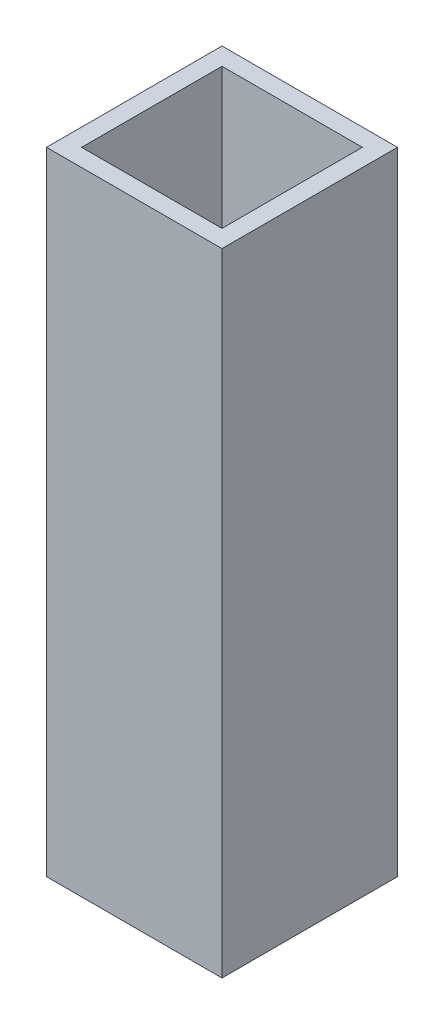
ISO-10303-21;
HEADER;
FILE_DESCRIPTION(('STEP AP214'),'2;1');
FILE_NAME('part.step','',(''),(''),'','','');
FILE_SCHEMA(('AUTOMOTIVE_DESIGN { 1 0 10303 214 1 1 1 1 }'));
ENDSEC;
DATA;
#1=APPLICATION_CONTEXT('core data for automotive mechanical design processes');
#2=APPLICATION_PROTOCOL_DEFINITION('international standard','automotive_design',2000,#1);
#3=PRODUCT_CONTEXT('',#1,'mechanical');
#4=PRODUCT('Part','Part','',(#3));
#5=PRODUCT_RELATED_PRODUCT_CATEGORY('part','',(#4));
#6=PRODUCT_DEFINITION_FORMATION('','',#4);
#7=PRODUCT_DEFINITION_CONTEXT('part definition',#1,'design');
#8=PRODUCT_DEFINITION('design','',#6,#7);
#9=PRODUCT_DEFINITION_SHAPE('','',#8);
#10=(LENGTH_UNIT() NAMED_UNIT(*) SI_UNIT(.MILLI.,.METRE.));
#11=(NAMED_UNIT(*) PLANE_ANGLE_UNIT() SI_UNIT($,.RADIAN.));
#12=(NAMED_UNIT(*) SI_UNIT($,.STERADIAN.) SOLID_ANGLE_UNIT());
#13=UNCERTAINTY_MEASURE_WITH_UNIT(LENGTH_MEASURE(1.E-05),#10,'distance_accuracy_value','');
#14=(GEOMETRIC_REPRESENTATION_CONTEXT(3) GLOBAL_UNCERTAINTY_ASSIGNED_CONTEXT((#13)) GLOBAL_UNIT_ASSIGNED_CONTEXT((#10,
#11,#12)) REPRESENTATION_CONTEXT('',''));
#15=CARTESIAN_POINT('',(0.,0.,0.));
#16=DIRECTION('',(0.,0.,1.));
#17=DIRECTION('',(1.,0.,0.));
#18=AXIS2_PLACEMENT_3D('',#15,#16,#17);
#19=CARTESIAN_POINT('',(6.25,45.,-6.25));
#20=DIRECTION('',(-1.,0.,0.));
#21=DIRECTION('',(0.,0.,1.));
#22=AXIS2_PLACEMENT_3D('',#19,#20,#21);
#23=PLANE('',#22);
#24=DIRECTION('',(0.,0.,-1.));
#25=VECTOR('',#24,1.);
#26=CARTESIAN_POINT('',(6.25,0.,-6.25));
#27=LINE('',#26,#25);
#28=CARTESIAN_POINT('',(6.25,0.,6.25));
#29=VERTEX_POINT('',#28);
#30=CARTESIAN_POINT('',(6.25,0.,-6.25));
#31=VERTEX_POINT('',#30);
#32=EDGE_CURVE('E155',#29,#31,#27,.T.);
#33=ORIENTED_EDGE('',*,*,#32,.T.);
#34=DIRECTION('',(0.,-1.,0.));
#35=VECTOR('',#34,1.);
#36=CARTESIAN_POINT('',(6.25,45.,-6.25));
#37=LINE('',#36,#35);
#38=CARTESIAN_POINT('',(6.25,45.,-6.25));
#39=VERTEX_POINT('',#38);
#40=EDGE_CURVE('E11',#39,#31,#37,.T.);
#41=ORIENTED_EDGE('',*,*,#40,.F.);
#42=DIRECTION('',(0.,0.,-1.));
#43=VECTOR('',#42,1.);
#44=CARTESIAN_POINT('',(6.25,45.,-6.25));
#45=LINE('',#44,#43);
#46=CARTESIAN_POINT('',(6.25,45.,6.25));
#47=VERTEX_POINT('',#46);
#48=EDGE_CURVE('E159',#47,#39,#45,.T.);
#49=ORIENTED_EDGE('',*,*,#48,.F.);
#50=DIRECTION('',(0.,-1.,0.));
#51=VECTOR('',#50,1.);
#52=CARTESIAN_POINT('',(6.25,45.,6.25));
#53=LINE('',#52,#51);
#54=EDGE_CURVE('E165',#47,#29,#53,.T.);
#55=ORIENTED_EDGE('',*,*,#54,.T.);
#56=EDGE_LOOP('',(#33,#41,#49,#55));
#57=FACE_BOUND('',#56,.T.);
#58=ADVANCED_FACE('F47',(#57),#23,.F.);
#59=CARTESIAN_POINT('',(-6.25,45.,-6.25));
#60=DIRECTION('',(0.,0.,1.));
#61=DIRECTION('',(1.,0.,0.));
#62=AXIS2_PLACEMENT_3D('',#59,#60,#61);
#63=PLANE('',#62);
#64=DIRECTION('',(-1.,0.,0.));
#65=VECTOR('',#64,1.);
#66=CARTESIAN_POINT('',(-6.25,0.,-6.25));
#67=LINE('',#66,#65);
#68=CARTESIAN_POINT('',(-6.25,0.,-6.25));
#69=VERTEX_POINT('',#68);
#70=EDGE_CURVE('E168',#31,#69,#67,.T.);
#71=ORIENTED_EDGE('',*,*,#70,.T.);
#72=DIRECTION('',(0.,-1.,0.));
#73=VECTOR('',#72,1.);
#74=CARTESIAN_POINT('',(-6.25,45.,-6.25));
#75=LINE('',#74,#73);
#76=CARTESIAN_POINT('',(-6.25,45.,-6.25));
#77=VERTEX_POINT('',#76);
#78=EDGE_CURVE('E54',#77,#69,#75,.T.);
#79=ORIENTED_EDGE('',*,*,#78,.F.);
#80=DIRECTION('',(-1.,0.,0.));
#81=VECTOR('',#80,1.);
#82=CARTESIAN_POINT('',(-6.25,45.,-6.25));
#83=LINE('',#82,#81);
#84=EDGE_CURVE('E98',#39,#77,#83,.T.);
#85=ORIENTED_EDGE('',*,*,#84,.F.);
#86=ORIENTED_EDGE('',*,*,#40,.T.);
#87=EDGE_LOOP('',(#71,#79,#85,#86));
#88=FACE_BOUND('',#87,.T.);
#89=ADVANCED_FACE('F197',(#88),#63,.F.);
#90=CARTESIAN_POINT('',(-6.25,45.,-6.25));
#91=DIRECTION('',(1.,0.,0.));
#92=DIRECTION('',(0.,0.,-1.));
#93=AXIS2_PLACEMENT_3D('',#90,#91,#92);
#94=PLANE('',#93);
#95=DIRECTION('',(0.,0.,1.));
#96=VECTOR('',#95,1.);
#97=CARTESIAN_POINT('',(-6.25,0.,-6.25));
#98=LINE('',#97,#96);
#99=CARTESIAN_POINT('',(-6.25,0.,6.25));
#100=VERTEX_POINT('',#99);
#101=EDGE_CURVE('E170',#69,#100,#98,.T.);
#102=ORIENTED_EDGE('',*,*,#101,.T.);
#103=DIRECTION('',(0.,-1.,0.));
#104=VECTOR('',#103,1.);
#105=CARTESIAN_POINT('',(-6.25,45.,6.25));
#106=LINE('',#105,#104);
#107=CARTESIAN_POINT('',(-6.25,45.,6.25));
#108=VERTEX_POINT('',#107);
#109=EDGE_CURVE('E174',#108,#100,#106,.T.);
#110=ORIENTED_EDGE('',*,*,#109,.F.);
#111=DIRECTION('',(0.,0.,1.));
#112=VECTOR('',#111,1.);
#113=CARTESIAN_POINT('',(-6.25,45.,-6.25));
#114=LINE('',#113,#112);
#115=EDGE_CURVE('E162',#77,#108,#114,.T.);
#116=ORIENTED_EDGE('',*,*,#115,.F.);
#117=ORIENTED_EDGE('',*,*,#78,.T.);
#118=EDGE_LOOP('',(#102,#110,#116,#117));
#119=FACE_BOUND('',#118,.T.);
#120=ADVANCED_FACE('F179',(#119),#94,.F.);
#121=CARTESIAN_POINT('',(-6.25,45.,6.25));
#122=DIRECTION('',(0.,0.,-1.));
#123=DIRECTION('',(-1.,0.,0.));
#124=AXIS2_PLACEMENT_3D('',#121,#122,#123);
#125=PLANE('',#124);
#126=DIRECTION('',(1.,0.,0.));
#127=VECTOR('',#126,1.);
#128=CARTESIAN_POINT('',(-6.25,0.,6.25));
#129=LINE('',#128,#127);
#130=EDGE_CURVE('E91',#100,#29,#129,.T.);
#131=ORIENTED_EDGE('',*,*,#130,.T.);
#132=ORIENTED_EDGE('',*,*,#54,.F.);
#133=DIRECTION('',(1.,0.,0.));
#134=VECTOR('',#133,1.);
#135=CARTESIAN_POINT('',(-6.25,45.,6.25));
#136=LINE('',#135,#134);
#137=EDGE_CURVE('E70',#108,#47,#136,.T.);
#138=ORIENTED_EDGE('',*,*,#137,.F.);
#139=ORIENTED_EDGE('',*,*,#109,.T.);
#140=EDGE_LOOP('',(#131,#132,#138,#139));
#141=FACE_BOUND('',#140,.T.);
#142=ADVANCED_FACE('F187',(#141),#125,.F.);
#143=CARTESIAN_POINT('',(0.,45.,0.));
#144=DIRECTION('',(0.,1.,0.));
#145=DIRECTION('',(0.,0.,1.));
#146=AXIS2_PLACEMENT_3D('',#143,#144,#145);
#147=PLANE('',#146);
#148=DIRECTION('',(0.,0.,-1.));
#149=VECTOR('',#148,1.);
#150=CARTESIAN_POINT('',(5.,45.,-5.));
#151=LINE('',#150,#149);
#152=CARTESIAN_POINT('',(5.,45.,5.));
#153=VERTEX_POINT('',#152);
#154=CARTESIAN_POINT('',(5.,45.,-5.));
#155=VERTEX_POINT('',#154);
#156=EDGE_CURVE('E61',#153,#155,#151,.T.);
#157=ORIENTED_EDGE('',*,*,#156,.F.);
#158=DIRECTION('',(1.,0.,0.));
#159=VECTOR('',#158,1.);
#160=CARTESIAN_POINT('',(-5.,45.,5.));
#161=LINE('',#160,#159);
#162=CARTESIAN_POINT('',(-5.,45.,5.));
#163=VERTEX_POINT('',#162);
#164=EDGE_CURVE('E140',#163,#153,#161,.T.);
#165=ORIENTED_EDGE('',*,*,#164,.F.);
#166=DIRECTION('',(0.,0.,1.));
#167=VECTOR('',#166,1.);
#168=CARTESIAN_POINT('',(-5.,45.,-5.));
#169=LINE('',#168,#167);
#170=CARTESIAN_POINT('',(-5.,45.,-5.));
#171=VERTEX_POINT('',#170);
#172=EDGE_CURVE('E143',#171,#163,#169,.T.);
#173=ORIENTED_EDGE('',*,*,#172,.F.);
#174=DIRECTION('',(-1.,0.,0.));
#175=VECTOR('',#174,1.);
#176=CARTESIAN_POINT('',(-5.,45.,-5.));
#177=LINE('',#176,#175);
#178=EDGE_CURVE('E149',#155,#171,#177,.T.);
#179=ORIENTED_EDGE('',*,*,#178,.F.);
#180=EDGE_LOOP('',(#157,#165,#173,#179));
#181=FACE_BOUND('',#180,.T.);
#182=ORIENTED_EDGE('',*,*,#48,.T.);
#183=ORIENTED_EDGE('',*,*,#84,.T.);
#184=ORIENTED_EDGE('',*,*,#115,.T.);
#185=ORIENTED_EDGE('',*,*,#137,.T.);
#186=EDGE_LOOP('',(#182,#183,#184,#185));
#187=FACE_BOUND('',#186,.T.);
#188=ADVANCED_FACE('F189',(#181,#187),#147,.T.);
#189=CARTESIAN_POINT('',(0.,0.,0.));
#190=DIRECTION('',(0.,1.,0.));
#191=DIRECTION('',(0.,0.,1.));
#192=AXIS2_PLACEMENT_3D('',#189,#190,#191);
#193=PLANE('',#192);
#194=ORIENTED_EDGE('',*,*,#32,.F.);
#195=ORIENTED_EDGE('',*,*,#130,.F.);
#196=ORIENTED_EDGE('',*,*,#101,.F.);
#197=ORIENTED_EDGE('',*,*,#70,.F.);
#198=EDGE_LOOP('',(#194,#195,#196,#197));
#199=FACE_BOUND('',#198,.T.);
#200=ADVANCED_FACE('F183',(#199),#193,.F.);
#201=CARTESIAN_POINT('',(5.,2.5,-5.));
#202=DIRECTION('',(1.,0.,0.));
#203=DIRECTION('',(0.,0.,-1.));
#204=AXIS2_PLACEMENT_3D('',#201,#202,#203);
#205=PLANE('',#204);
#206=ORIENTED_EDGE('',*,*,#156,.T.);
#207=DIRECTION('',(0.,1.,0.));
#208=VECTOR('',#207,1.);
#209=CARTESIAN_POINT('',(5.,2.5,-5.));
#210=LINE('',#209,#208);
#211=CARTESIAN_POINT('',(5.,2.5,-5.));
#212=VERTEX_POINT('',#211);
#213=EDGE_CURVE('E118',#212,#155,#210,.T.);
#214=ORIENTED_EDGE('',*,*,#213,.F.);
#215=DIRECTION('',(0.,0.,-1.));
#216=VECTOR('',#215,1.);
#217=CARTESIAN_POINT('',(5.,2.5,-5.));
#218=LINE('',#217,#216);
#219=CARTESIAN_POINT('',(5.,2.5,5.));
#220=VERTEX_POINT('',#219);
#221=EDGE_CURVE('E122',#220,#212,#218,.T.);
#222=ORIENTED_EDGE('',*,*,#221,.F.);
#223=DIRECTION('',(0.,1.,0.));
#224=VECTOR('',#223,1.);
#225=CARTESIAN_POINT('',(5.,2.5,5.));
#226=LINE('',#225,#224);
#227=EDGE_CURVE('E153',#220,#153,#226,.T.);
#228=ORIENTED_EDGE('',*,*,#227,.T.);
#229=EDGE_LOOP('',(#206,#214,#222,#228));
#230=FACE_BOUND('',#229,.T.);
#231=ADVANCED_FACE('F120',(#230),#205,.F.);
#232=CARTESIAN_POINT('',(-5.,2.5,5.));
#233=DIRECTION('',(0.,0.,1.));
#234=DIRECTION('',(1.,0.,0.));
#235=AXIS2_PLACEMENT_3D('',#232,#233,#234);
#236=PLANE('',#235);
#237=ORIENTED_EDGE('',*,*,#164,.T.);
#238=ORIENTED_EDGE('',*,*,#227,.F.);
#239=DIRECTION('',(1.,0.,0.));
#240=VECTOR('',#239,1.);
#241=CARTESIAN_POINT('',(-5.,2.5,5.));
#242=LINE('',#241,#240);
#243=CARTESIAN_POINT('',(-5.,2.5,5.));
#244=VERTEX_POINT('',#243);
#245=EDGE_CURVE('E128',#244,#220,#242,.T.);
#246=ORIENTED_EDGE('',*,*,#245,.F.);
#247=DIRECTION('',(0.,1.,0.));
#248=VECTOR('',#247,1.);
#249=CARTESIAN_POINT('',(-5.,2.5,5.));
#250=LINE('',#249,#248);
#251=EDGE_CURVE('E156',#244,#163,#250,.T.);
#252=ORIENTED_EDGE('',*,*,#251,.T.);
#253=EDGE_LOOP('',(#237,#238,#246,#252));
#254=FACE_BOUND('',#253,.T.);
#255=ADVANCED_FACE('F236',(#254),#236,.F.);
#256=CARTESIAN_POINT('',(-5.,2.5,-5.));
#257=DIRECTION('',(-1.,0.,0.));
#258=DIRECTION('',(0.,0.,1.));
#259=AXIS2_PLACEMENT_3D('',#256,#257,#258);
#260=PLANE('',#259);
#261=ORIENTED_EDGE('',*,*,#172,.T.);
#262=ORIENTED_EDGE('',*,*,#251,.F.);
#263=DIRECTION('',(0.,0.,1.));
#264=VECTOR('',#263,1.);
#265=CARTESIAN_POINT('',(-5.,2.5,-5.));
#266=LINE('',#265,#264);
#267=CARTESIAN_POINT('',(-5.,2.5,-5.));
#268=VERTEX_POINT('',#267);
#269=EDGE_CURVE('E136',#268,#244,#266,.T.);
#270=ORIENTED_EDGE('',*,*,#269,.F.);
#271=DIRECTION('',(0.,1.,0.));
#272=VECTOR('',#271,1.);
#273=CARTESIAN_POINT('',(-5.,2.5,-5.));
#274=LINE('',#273,#272);
#275=EDGE_CURVE('E127',#268,#171,#274,.T.);
#276=ORIENTED_EDGE('',*,*,#275,.T.);
#277=EDGE_LOOP('',(#261,#262,#270,#276));
#278=FACE_BOUND('',#277,.T.);
#279=ADVANCED_FACE('F245',(#278),#260,.F.);
#280=CARTESIAN_POINT('',(-5.,2.5,-5.));
#281=DIRECTION('',(0.,0.,-1.));
#282=DIRECTION('',(-1.,0.,0.));
#283=AXIS2_PLACEMENT_3D('',#280,#281,#282);
#284=PLANE('',#283);
#285=ORIENTED_EDGE('',*,*,#178,.T.);
#286=ORIENTED_EDGE('',*,*,#275,.F.);
#287=DIRECTION('',(-1.,0.,0.));
#288=VECTOR('',#287,1.);
#289=CARTESIAN_POINT('',(-5.,2.5,-5.));
#290=LINE('',#289,#288);
#291=EDGE_CURVE('E131',#212,#268,#290,.T.);
#292=ORIENTED_EDGE('',*,*,#291,.F.);
#293=ORIENTED_EDGE('',*,*,#213,.T.);
#294=EDGE_LOOP('',(#285,#286,#292,#293));
#295=FACE_BOUND('',#294,.T.);
#296=ADVANCED_FACE('F132',(#295),#284,.F.);
#297=CARTESIAN_POINT('',(0.,2.5,0.));
#298=DIRECTION('',(0.,1.,0.));
#299=DIRECTION('',(0.,0.,1.));
#300=AXIS2_PLACEMENT_3D('',#297,#298,#299);
#301=PLANE('',#300);
#302=ORIENTED_EDGE('',*,*,#221,.T.);
#303=ORIENTED_EDGE('',*,*,#291,.T.);
#304=ORIENTED_EDGE('',*,*,#269,.T.);
#305=ORIENTED_EDGE('',*,*,#245,.T.);
#306=EDGE_LOOP('',(#302,#303,#304,#305));
#307=FACE_BOUND('',#306,.T.);
#308=ADVANCED_FACE('F138',(#307),#301,.T.);
#309=CLOSED_SHELL('',(#58,#89,#120,#142,#188,#200,#231,#255,#279,#296,#308));
#310=MANIFOLD_SOLID_BREP('B2',#309);
#311=ADVANCED_BREP_SHAPE_REPRESENTATION('',(#18,#310),#14);
#312=SHAPE_DEFINITION_REPRESENTATION(#9,#311);
ENDSEC;
END-ISO-10303-21;
